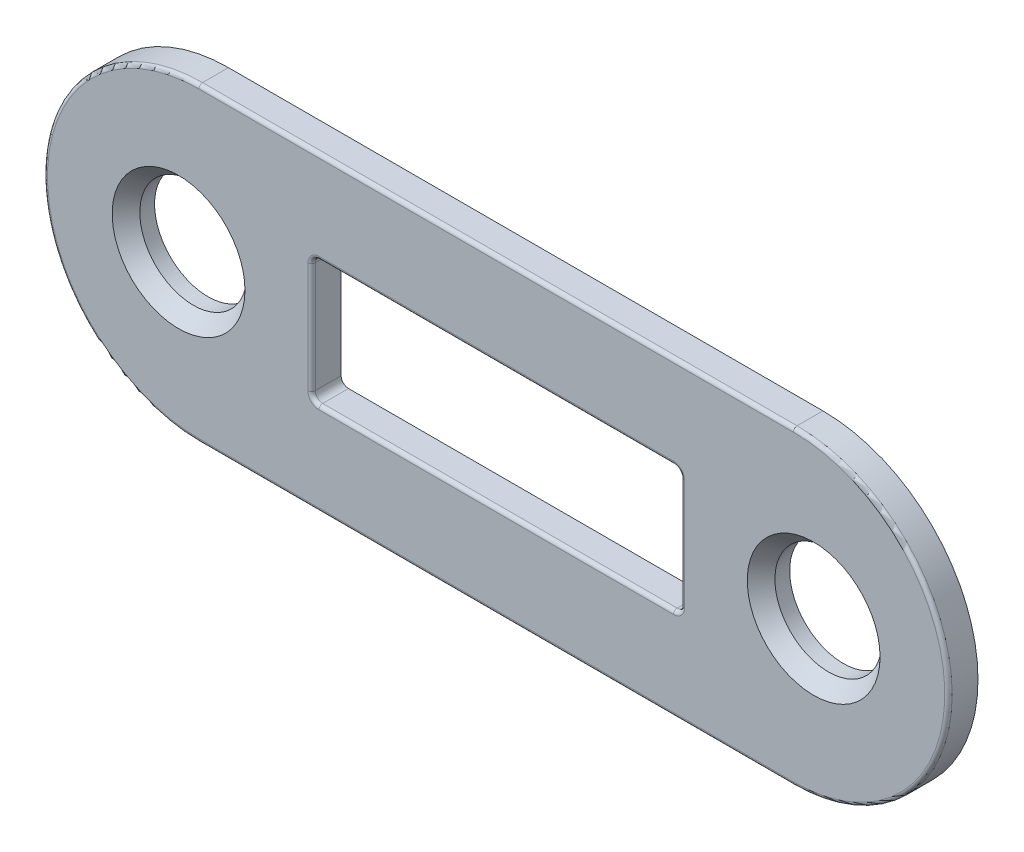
from build123d import *

# Parameters (mm, degrees)
BASE_EXTRUDE_DEPTH                           = 2
FILLET1_R                                    = 0.25
CUT_EXTRUDE2_DEPTH                           = 55.959644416
CSK_FOR_1_4_FLAT_HEAD_SOCKET_CAP_SCR_2_COUNT = 2
CSK_FOR_1_4_FLAT_HEAD_SOCKET_CAP_SCR_2_PITCH = 43
FILLET2_R                                    = 0.25


with BuildPart() as part:
    # Sketch3 → Base-Extrude (new body)
    with BuildSketch(Plane.XY):
        with BuildLine():
            Line((0, 0), (40.25, 0))
            ThreePointArc((40.25, 0), (50.75, 10.5), (40.25, 21))
            Line((40.25, 21), (0, 21))
            ThreePointArc((0, 21), (-10.5, 10.5), (0, 0))
        make_face()
    extrude(amount=BASE_EXTRUDE_DEPTH)

    # Fillet1
    fillet1_edges = [part.edges().sort_by_distance(p)[0] for p in [
        (50.75, 10.5, 2),
        (20.125, 21, 2),
        (-10.5, 10.5, 2),
        (20.125, 0, 2),
    ]]
    fillet(fillet1_edges, radius=FILLET1_R)

    # Sketch6 → Cut-Extrude2 (cut, through all)
    with BuildSketch(Plane.XY.offset(2)):
        with BuildLine():
            Line((7.63, 14.25), (7.63, 10.5))
            Line((7.63, 10.5), (7.63, 6.75))
            ThreePointArc((7.63, 6.75), (7.776446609, 6.396446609), (8.13, 6.25))
            Line((8.13, 6.25), (12.800144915, 6.25))
            Line((12.800144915, 6.25), (27.449855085, 6.25))
            Line((27.449855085, 6.25), (32.13, 6.25))
            ThreePointArc((32.13, 6.25), (32.483553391, 6.396446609), (32.63, 6.75))
            Line((32.63, 6.75), (32.63, 10.5))
            Line((32.63, 10.5), (32.63, 14.25))
            ThreePointArc((32.63, 14.25), (32.483553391, 14.603553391), (32.13, 14.75))
            Line((32.13, 14.75), (27.449855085, 14.75))
            Line((27.449855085, 14.75), (12.800144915, 14.75))
            Line((12.800144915, 14.75), (8.13, 14.75))
            ThreePointArc((8.13, 14.75), (7.776446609, 14.603553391), (7.63, 14.25))
        make_face()
    extrude(amount=-CUT_EXTRUDE2_DEPTH, mode=Mode.SUBTRACT)

    # Sketch7 → CSK for 1_4 Flat Head Socket Cap Screw1 (revolve, cut)
    with BuildSketch(Plane(origin=(-1.376453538, 10.5, 2), x_dir=(0, -1, 0), z_dir=(1, 0, 0))):
        Polygon((0, 0), (0, 2), (3.624999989, 2), (3.624999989, 1.001740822), (4.4958, 0), align=None)
    csk_for_1_4_flat_head_socket_cap_screw1 = revolve(axis=Axis((-1.376453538, 10.5, 8.35), (0, 0, -1)), mode=Mode.SUBTRACT)

    # CSK for 1_4 Flat Head Socket Cap Scr 2: CSK for 1_4 Flat Head Socket Cap Screw1 ×2
    with Locations(*[(i * CSK_FOR_1_4_FLAT_HEAD_SOCKET_CAP_SCR_2_PITCH, 0, 0) for i in range(1, CSK_FOR_1_4_FLAT_HEAD_SOCKET_CAP_SCR_2_COUNT)]):
        add(csk_for_1_4_flat_head_socket_cap_screw1, mode=Mode.SUBTRACT)

    # Fillet2
    fillet2_edges = [part.edges().sort_by_distance(p)[0] for p in [
        (7.776446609, 14.603553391, 2),
        (7.63, 10.5, 2),
        (7.776446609, 6.396446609, 2),
        (20.13, 6.25, 2),
        (32.483553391, 6.396446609, 2),
        (32.63, 10.5, 2),
        (32.483553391, 14.603553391, 2),
        (20.13, 14.75, 2),
    ]]
    fillet(fillet2_edges, radius=FILLET2_R)


solid = part.part
